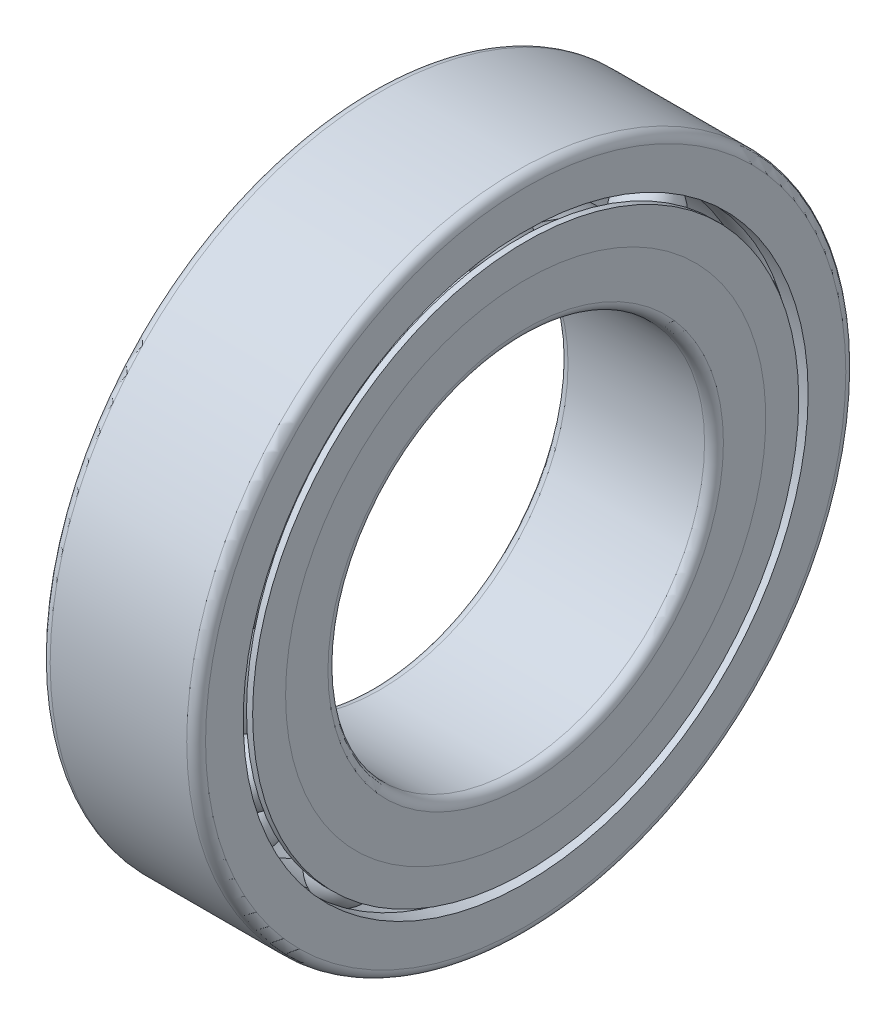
from build123d import *

# Parameters (mm, degrees)
R_P_TITION_CIRCULAIRE1_COUNT = 10


with BuildPart() as part:
    # Esquisse1 → R_volution1 (revolve)
    with BuildSketch(Plane.XY, mode=Mode.PRIVATE) as r_volution1_sk:
        with BuildLine():
            Line((-16.5, 51), (-16.5, 42))
            ThreePointArc((-16.5, 42), (-15.914213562, 40.585786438), (-14.5, 40))
            Line((-14.5, 40), (14.5, 40))
            ThreePointArc((14.5, 40), (15.914213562, 40.585786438), (16.5, 42))
            Line((16.5, 42), (16.5, 51))
            Line((16.5, 51), (14.472135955, 51))
            ThreePointArc((14.472135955, 51), (10, 49), (5.527864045, 51))
            Line((5.527864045, 51), (-5.527864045, 51))
            ThreePointArc((-5.527864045, 51), (-10, 49), (-14.472135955, 51))
            Line((-14.472135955, 51), (-16.5, 51))
        make_face()
    revolve(r_volution1_sk.sketch.rotate(Axis((23, 0, 0), (-1, 0, 0)), 270), axis=Axis((23, 0, 0), (-1, 0, 0)))


with BuildPart() as body_2:
    # Esquisse2 → R_volution2 (revolve)
    with BuildSketch(Plane.XY, mode=Mode.PRIVATE) as r_volution2_sk:
        with BuildLine():
            Line((-16.5, 68), (-16.5, 60))
            Line((-16.5, 60), (-13.268767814, 60))
            ThreePointArc((-13.268767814, 60), (-9.999975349, 60.96859902), (-6.731182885, 60))
            Line((-6.731182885, 60), (6.68337521, 60))
            ThreePointArc((6.68337521, 60), (10, 61), (13.31662479, 60))
            Line((13.31662479, 60), (16.5, 60))
            Line((16.5, 60), (16.5, 68))
            ThreePointArc((16.5, 68), (15.914213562, 69.414213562), (14.5, 70))
            Line((14.5, 70), (-14.5, 70))
            ThreePointArc((-14.5, 70), (-15.914213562, 69.414213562), (-16.5, 68))
        make_face()
    revolve(r_volution2_sk.sketch.rotate(Axis((23, 0, 0), (-1, 0, 0)), 90), axis=Axis((23, 0, 0), (-1, 0, 0)))


with BuildPart() as body_3:
    # Esquisse3 → R_volution3 (revolve)
    with BuildSketch(Plane.XY):
        with BuildLine():
            Line((-16, 55), (-4, 55))
            ThreePointArc((-4, 55), (-10, 49), (-16, 55))
        make_face()
        with BuildLine():
            Line((4, 55), (16, 55))
            ThreePointArc((16, 55), (10, 49), (4, 55))
        make_face()
    revolve(axis=Axis((-11.94885829, 55, 0), (1, 0, 0)))


with BuildPart() as body_4:
    # Esquisse4 → R_volution4 (revolve)
    with BuildSketch(Plane.XY, mode=Mode.PRIVATE) as r_volution4_sk:
        with BuildLine():
            Line((-16.5, 58), (-16.5, 51))
            Line((-16.5, 51), (-14.472135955, 51))
            ThreePointArc((-14.472135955, 51), (-15.968161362, 54.382707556), (-15.196152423, 58))
            Line((-15.196152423, 58), (-16.5, 58))
        make_face()
    revolve(r_volution4_sk.sketch.rotate(Axis((0, 0, 0), (1, 0, 0)), 90), axis=Axis((0, 0, 0), (1, 0, 0)))


with BuildPart() as r_p_tition_circulaire1_1:
    # R_p_tition circulaire1: pattern copy
    add(body_3.part.rotate(Axis((0, 0, 0), (1, 0, 0)), 1 * 360 / R_P_TITION_CIRCULAIRE1_COUNT))


with BuildPart() as r_p_tition_circulaire1_2:
    # R_p_tition circulaire1: pattern copy
    add(body_3.part.rotate(Axis((0, 0, 0), (1, 0, 0)), 2 * 360 / R_P_TITION_CIRCULAIRE1_COUNT))


with BuildPart() as r_p_tition_circulaire1_3:
    # R_p_tition circulaire1: pattern copy
    add(body_3.part.rotate(Axis((0, 0, 0), (1, 0, 0)), 3 * 360 / R_P_TITION_CIRCULAIRE1_COUNT))


with BuildPart() as r_p_tition_circulaire1_4:
    # R_p_tition circulaire1: pattern copy
    add(body_3.part.rotate(Axis((0, 0, 0), (1, 0, 0)), 4 * 360 / R_P_TITION_CIRCULAIRE1_COUNT))


with BuildPart() as r_p_tition_circulaire1_5:
    # R_p_tition circulaire1: pattern copy
    add(body_3.part.rotate(Axis((0, 0, 0), (1, 0, 0)), 5 * 360 / R_P_TITION_CIRCULAIRE1_COUNT))


with BuildPart() as r_p_tition_circulaire1_6:
    # R_p_tition circulaire1: pattern copy
    add(body_3.part.rotate(Axis((0, 0, 0), (1, 0, 0)), 6 * 360 / R_P_TITION_CIRCULAIRE1_COUNT))


with BuildPart() as r_p_tition_circulaire1_7:
    # R_p_tition circulaire1: pattern copy
    add(body_3.part.rotate(Axis((0, 0, 0), (1, 0, 0)), 7 * 360 / R_P_TITION_CIRCULAIRE1_COUNT))


with BuildPart() as r_p_tition_circulaire1_8:
    # R_p_tition circulaire1: pattern copy
    add(body_3.part.rotate(Axis((0, 0, 0), (1, 0, 0)), 8 * 360 / R_P_TITION_CIRCULAIRE1_COUNT))


with BuildPart() as r_p_tition_circulaire1_9:
    # R_p_tition circulaire1: pattern copy
    add(body_3.part.rotate(Axis((0, 0, 0), (1, 0, 0)), 9 * 360 / R_P_TITION_CIRCULAIRE1_COUNT))


with BuildPart() as body_14:
    # Sym_trie1: mirrored copy
    add(body_4.part.mirror(Plane(origin=(0, 0, 0), x_dir=(0, 0, 1), z_dir=(1, 0, 0))))


solid = Compound([part.part, body_2.part, body_3.part, body_4.part, r_p_tition_circulaire1_1.part, r_p_tition_circulaire1_2.part, r_p_tition_circulaire1_3.part, r_p_tition_circulaire1_4.part, r_p_tition_circulaire1_5.part, r_p_tition_circulaire1_6.part, r_p_tition_circulaire1_7.part, r_p_tition_circulaire1_8.part, r_p_tition_circulaire1_9.part, body_14.part])
